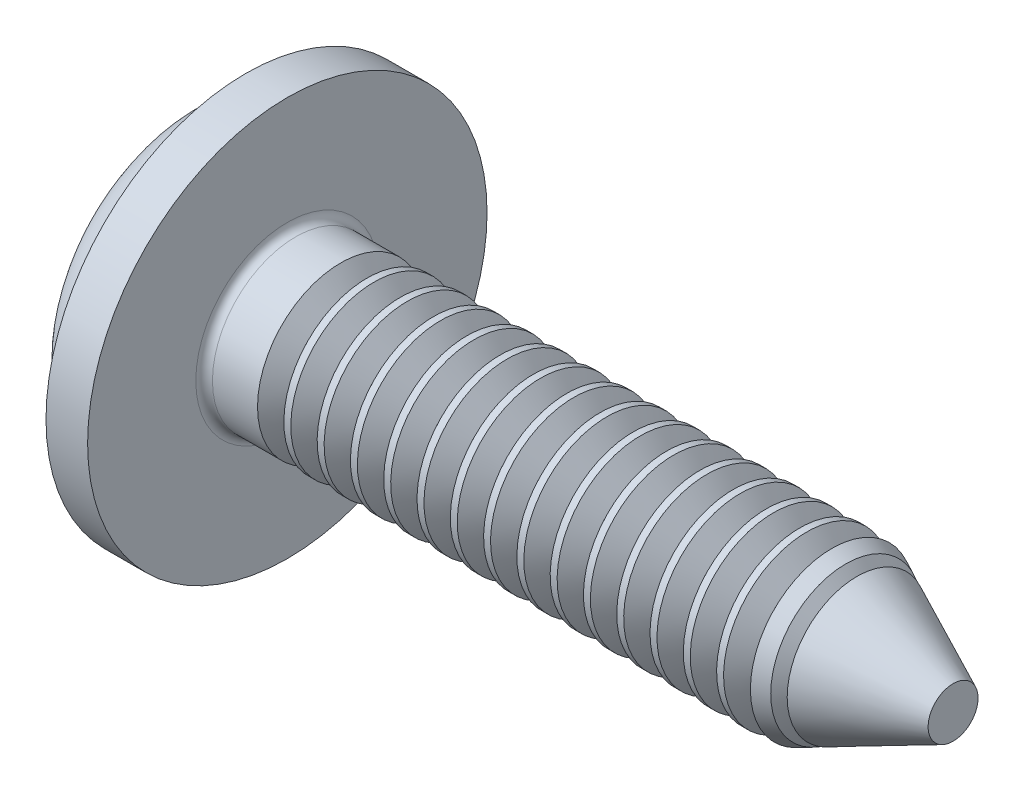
from build123d import *

# Parameters (mm, degrees)
FILLET1_R                = 0.1
RECPAT_COUNT             = 2
RECPAT_ANGLE             = 90
THDSCHPAT_COUNT          = 19
THDSCHPAT_PITCH          = 0.4
ESBO_O1_R                = 2.4
RESSALTO_EXTRUS_O1_DEPTH = 0.5


with BuildPart() as part:
    # BodySke → Base-Revolve (revolve)
    with BuildSketch(Plane.XY, mode=Mode.PRIVATE) as base_revolve_sk:
        with BuildLine():
            Line((1.6, 1), (1.6, 2))
            Line((1.6, 2), (1.1, 2))
            ThreePointArc((1.1, 2), (0.688403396, 1.885994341), (0.394117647, 1.576470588))
            ThreePointArc((0.394117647, 1.576470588), (0.100022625, 0.812494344), (0, 0))
            Line((0, 0), (9.6, 0))
            Line((9.6, 0), (9.6, 1))
            Line((9.6, 1), (1.6, 1))
        make_face()
    revolve(base_revolve_sk.sketch.rotate(Axis((1.1, 0, 0), (1, 0, 0)), 90), axis=Axis((1.1, 0, 0), (1, 0, 0)))

    # Fillet1
    fillet1_edges = [part.edges().sort_by_distance(p)[0] for p in [
        (1.6, 0, -1),
    ]]
    fillet(fillet1_edges, radius=FILLET1_R)

    # Sketch3 → Recess section 0
    with BuildSketch(Plane(origin=(0, 0, 0), x_dir=(0, 0, -1), z_dir=(1, 0, 0))):
        with BuildLine():
            Line((0.24, -1.05), (-0.24, -1.05))
            Line((-0.24, -1.05), (-0.24, 1.05))
            Line((-0.24, 1.05), (0.24, 1.05))
            Line((0.24, 1.05), (0.24, -1.05))
        make_face()
    # Sketch4 → Recess section 1
    with BuildSketch(Plane(origin=(1.42, 0, 0), x_dir=(0, 0, -1), z_dir=(1, 0, 0))):
        with BuildLine():
            Line((0.24, -0.342014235), (-0.24, -0.342014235))
            Line((-0.24, -0.342014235), (-0.24, 0.342014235))
            Line((-0.24, 0.342014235), (0.24, 0.342014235))
            Line((0.24, 0.342014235), (0.24, -0.342014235))
        make_face()
    recess = loft(mode=Mode.SUBTRACT)

    # RecPat: Recess ×2 about axis
    recpat_axis = Axis((0, 0, 0), (1, 0, 0))
    for i in range(1, RECPAT_COUNT):
        add(recess.rotate(recpat_axis, i * RECPAT_ANGLE / (RECPAT_COUNT - 1)), mode=Mode.SUBTRACT)

    # RecCorSke → RecessCore (revolve, cut)
    with BuildSketch(Plane.XY, mode=Mode.PRIVATE) as recesscore_sk:
        Polygon((0, 0), (0, 0.454796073), (1.42, 0.3555), (1.535508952, 0), align=None)
    revolve(recesscore_sk.sketch.rotate(Axis((-3.175, 0, 0), (1, 0, 0)), 13.849905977), axis=Axis((-3.175, 0, 0), (1, 0, 0)), mode=Mode.SUBTRACT)

    # ThdSchSke → ThreadSchematic (revolve, cut)
    with BuildSketch(Plane.XY, mode=Mode.PRIVATE) as threadschematic_sk:
        Polygon((2.4, -0.774), (2.241753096, -1), (2.241753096, -1.25), (2.558246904, -1.25), (2.558246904, -1), align=None)
    threadschematic = revolve(threadschematic_sk.sketch.rotate(Axis((-3.175, 0, 0), (1, 0, 0)), 270), axis=Axis((-3.175, 0, 0), (1, 0, 0)), mode=Mode.SUBTRACT)

    # ThdSchPat: ThreadSchematic ×19
    with Locations(*[(i * THDSCHPAT_PITCH, 0, 0) for i in range(1, THDSCHPAT_COUNT)]):
        add(threadschematic, mode=Mode.SUBTRACT)

    # Esbo_o1 → Ressalto-extrus_o1 (add)
    with BuildSketch(Plane(origin=(1.6, 0, 0), x_dir=(0, 0, -1), z_dir=(1, 0, 0))):
        Circle(ESBO_O1_R)
    extrude(amount=-RESSALTO_EXTRUS_O1_DEPTH)

    # Esbo_o2 → Corte-Revolu_o1 (revolve, cut)
    with BuildSketch(Plane(origin=(0, 0, 0), x_dir=(1, 0, 0), z_dir=(0, 1, 0)), mode=Mode.PRIVATE) as corte_revolu_o1_sk:
        Polygon((9.6, 0.3), (8.1, 1), (9.6, 1), align=None)
    revolve(corte_revolu_o1_sk.sketch.rotate(Axis((0, 0, 0), (1, 0, 0)), 270), axis=Axis((0, 0, 0), (1, 0, 0)), mode=Mode.SUBTRACT)


solid = part.part
